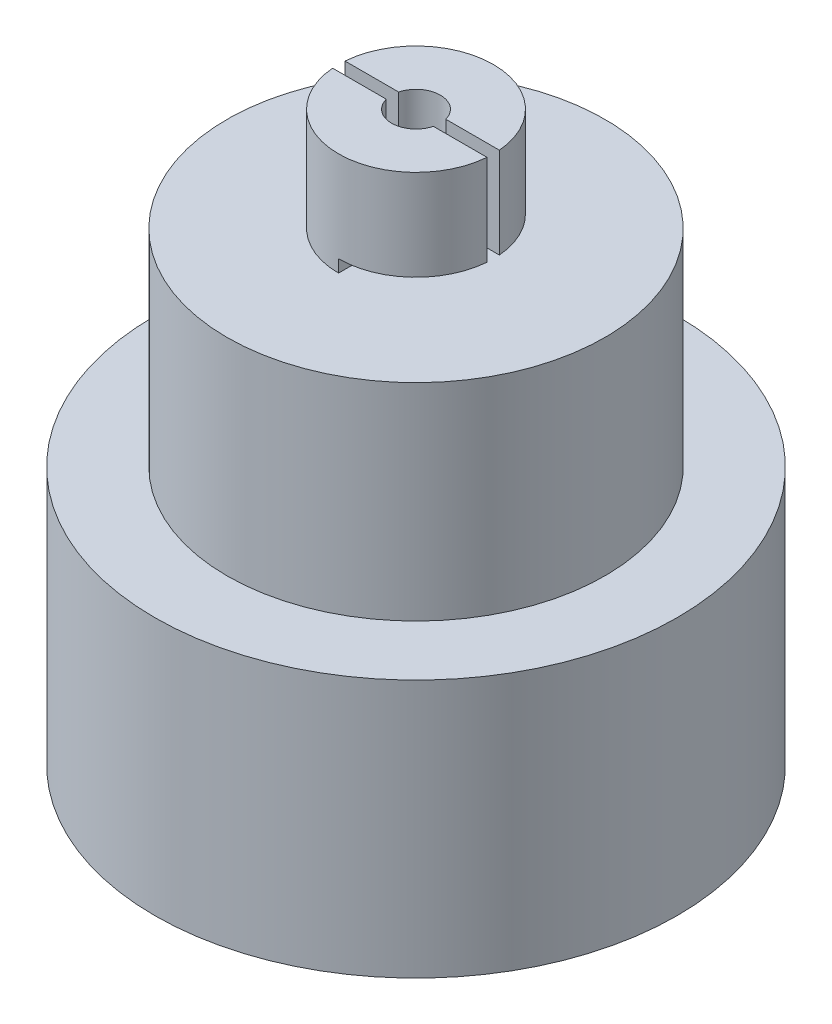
from build123d import *

# Parameters (mm, degrees)
SKETCH1_R           = 16.0655
BASE_EXTRUDE_DEPTH  = 15.875
SKETCH2_R           = 11.6205
BOSS_EXTRUDE1_DEPTH = 12.7
BOSS_EXTRUDE2_DEPTH = 6.35
SKETCH4_R           = 1.4986
CUT_EXTRUDE1_DEPTH  = 6.35
SKETCH5_R           = 12.446
CUT_EXTRUDE2_DEPTH  = 12.7
SKETCH6_R           = 7.62
CUT_EXTRUDE3_DEPTH  = 12.7
SKETCH9_W           = 8.45178824
SKETCH9_H           = 14.725524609
CUT_EXTRUDE6_DEPTH  = 0.762


with BuildPart() as part:
    # Sketch1 → Base-Extrude (new body)
    with BuildSketch(Plane(origin=(0, 0, 0), x_dir=(1, 0, 0), z_dir=(0, 1, 0))):
        with Locations(Location((0, 0, 0), (0, 0, 270))):
            Circle(SKETCH1_R)
    extrude(amount=BASE_EXTRUDE_DEPTH)

    # Sketch2 → Boss-Extrude1 (add)
    with BuildSketch(Plane(origin=(0, 15.875, 0), x_dir=(-1, 0, 0), z_dir=(0, 1, 0))):
        with Locations(Location((0, 0, 0), (0, 0, 90))):
            Circle(SKETCH2_R)
    extrude(amount=BOSS_EXTRUDE1_DEPTH)

    # Sketch3 → Boss-Extrude2 (add)
    with BuildSketch(Plane(origin=(0, 28.575, 0), x_dir=(-1, 0, 0), z_dir=(0, 1, 0))):
        with BuildLine():
            Line((-4.747235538, -0.381), (4.747235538, -0.381))
            ThreePointArc((4.747235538, -0.381), (0, -4.7625), (-4.747235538, -0.381))
        make_face()
        with BuildLine():
            Line((-4.747235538, 0.381), (4.747235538, 0.381))
            ThreePointArc((4.747235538, 0.381), (0, 4.7625), (-4.747235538, 0.381))
        make_face()
    extrude(amount=BOSS_EXTRUDE2_DEPTH)

    # Sketch4 → Cut-Extrude1 (cut)
    with BuildSketch(Plane(origin=(0, 34.925, 0), x_dir=(-1, 0, 0), z_dir=(0, 1, 0))):
        Circle(SKETCH4_R)
    extrude(amount=-CUT_EXTRUDE1_DEPTH, mode=Mode.SUBTRACT)

    # Sketch5 → Cut-Extrude2 (cut)
    with BuildSketch(Plane.XZ):
        with Locations(Location((0, 0, 0), (0, 0, 270))):
            Circle(SKETCH5_R)
    extrude(amount=-CUT_EXTRUDE2_DEPTH, mode=Mode.SUBTRACT)

    # Sketch6 → Cut-Extrude3 (cut)
    with BuildSketch(Plane.XZ.offset(-12.7)):
        with Locations(Location((0, 0, 0), (0, 0, 270))):
            Circle(SKETCH6_R)
    extrude(amount=-CUT_EXTRUDE3_DEPTH, mode=Mode.SUBTRACT)

    # Sketch7 → Boss-Revolve1 (revolve)
    with BuildSketch(Plane(origin=(0, 0, 0), x_dir=(0, 0, -1), z_dir=(1, 0, 0)), mode=Mode.PRIVATE) as boss_revolve1_sk:
        Polygon((0, 25.4), (1.833087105, 25.4), (0, 22.225), align=None)
    revolve(boss_revolve1_sk.sketch.rotate(Axis((0, -0.928936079, 0), (0, 1, 0)), 180), axis=Axis((0, -0.928936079, 0), (0, 1, 0)))

    # Sketch9 → Cut-Extrude6 (cut)
    with BuildSketch(Plane(origin=(0, 28.575, 0), x_dir=(1, 0, 0), z_dir=(0, 1, 0))):
        with Locations((4.22589412, 0.118372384)):
            Rectangle(SKETCH9_W, SKETCH9_H)
    extrude(amount=CUT_EXTRUDE6_DEPTH, mode=Mode.SUBTRACT)


solid = part.part
